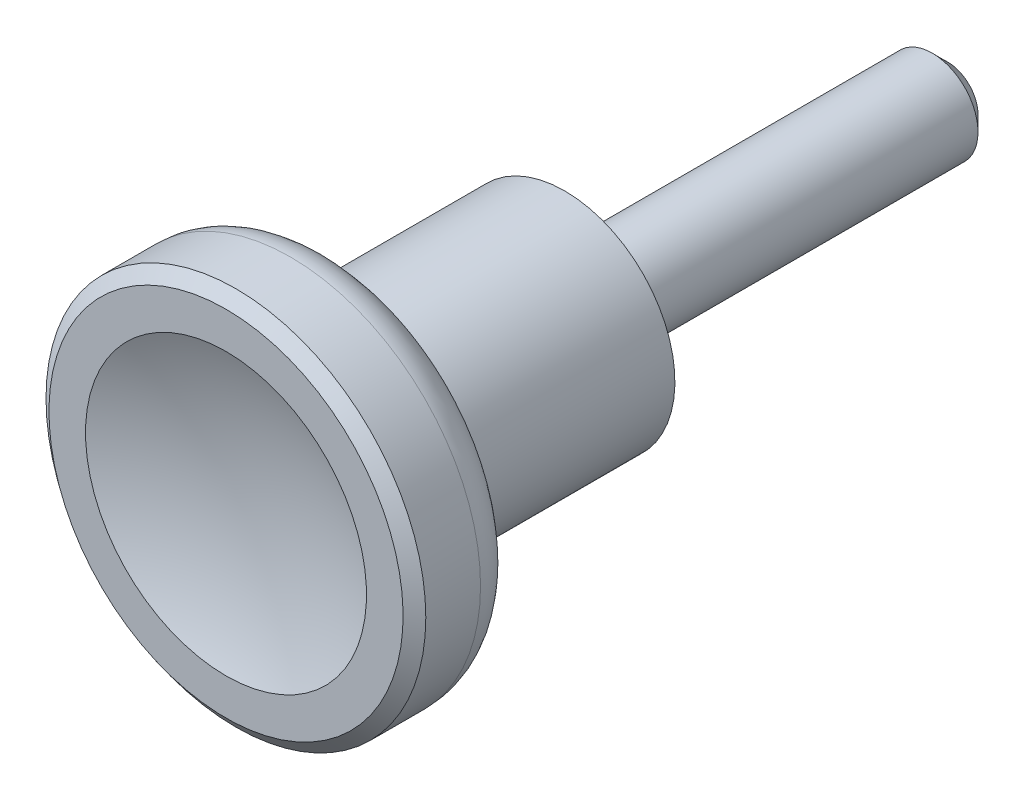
ISO-10303-21;
HEADER;
FILE_DESCRIPTION(('STEP AP214'),'2;1');
FILE_NAME('part.step','',(''),(''),'','','');
FILE_SCHEMA(('AUTOMOTIVE_DESIGN { 1 0 10303 214 1 1 1 1 }'));
ENDSEC;
DATA;
#1=APPLICATION_CONTEXT('core data for automotive mechanical design processes');
#2=APPLICATION_PROTOCOL_DEFINITION('international standard','automotive_design',2000,#1);
#3=PRODUCT_CONTEXT('',#1,'mechanical');
#4=PRODUCT('Part','Part','',(#3));
#5=PRODUCT_RELATED_PRODUCT_CATEGORY('part','',(#4));
#6=PRODUCT_DEFINITION_FORMATION('','',#4);
#7=PRODUCT_DEFINITION_CONTEXT('part definition',#1,'design');
#8=PRODUCT_DEFINITION('design','',#6,#7);
#9=PRODUCT_DEFINITION_SHAPE('','',#8);
#10=(LENGTH_UNIT() NAMED_UNIT(*) SI_UNIT(.MILLI.,.METRE.));
#11=(NAMED_UNIT(*) PLANE_ANGLE_UNIT() SI_UNIT($,.RADIAN.));
#12=(NAMED_UNIT(*) SI_UNIT($,.STERADIAN.) SOLID_ANGLE_UNIT());
#13=UNCERTAINTY_MEASURE_WITH_UNIT(LENGTH_MEASURE(1.E-05),#10,'distance_accuracy_value','');
#14=(GEOMETRIC_REPRESENTATION_CONTEXT(3) GLOBAL_UNCERTAINTY_ASSIGNED_CONTEXT((#13)) GLOBAL_UNIT_ASSIGNED_CONTEXT((#10,
#11,#12)) REPRESENTATION_CONTEXT('',''));
#15=CARTESIAN_POINT('',(0.,0.,0.));
#16=DIRECTION('',(0.,0.,1.));
#17=DIRECTION('',(1.,0.,0.));
#18=AXIS2_PLACEMENT_3D('',#15,#16,#17);
#19=CARTESIAN_POINT('',(0.,0.,43.6847281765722));
#20=DIRECTION('',(0.,-1.,0.));
#21=DIRECTION('',(1.,0.,0.));
#22=AXIS2_PLACEMENT_3D('',#19,#20,#21);
#23=SPHERICAL_SURFACE('',#22,23.1163945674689);
#24=CARTESIAN_POINT('',(0.,0.,43.6847281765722));
#25=DIRECTION('',(0.,0.,-1.));
#26=DIRECTION('',(0.,1.,0.));
#27=AXIS2_PLACEMENT_3D('',#24,#25,#26);
#28=SPHERICAL_SURFACE('',#27,23.1163945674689);
#29=CARTESIAN_POINT('',(0.,0.,22.4988392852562));
#30=DIRECTION('',(0.,0.,-1.));
#31=DIRECTION('',(0.,1.,0.));
#32=AXIS2_PLACEMENT_3D('',#29,#30,#31);
#33=CIRCLE('',#32,9.24801652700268);
#34=CARTESIAN_POINT('',(0.,9.24801652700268,22.4988392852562));
#35=VERTEX_POINT('',#34);
#36=EDGE_CURVE('E56',#35,#35,#33,.T.);
#37=ORIENTED_EDGE('',*,*,#36,.F.);
#38=EDGE_LOOP('',(#37));
#39=FACE_BOUND('',#38,.T.);
#40=ADVANCED_FACE('F12',(#39),#28,.F.);
#41=CARTESIAN_POINT('',(3.,0.,-25.));
#42=DIRECTION('',(0.,0.,1.));
#43=DIRECTION('',(0.,-1.,0.));
#44=AXIS2_PLACEMENT_3D('',#41,#42,#43);
#45=PLANE('',#44);
#46=CARTESIAN_POINT('',(0.,0.,-25.));
#47=DIRECTION('',(0.,0.,1.));
#48=DIRECTION('',(1.,0.,0.));
#49=AXIS2_PLACEMENT_3D('',#46,#47,#48);
#50=CIRCLE('',#49,2.);
#51=CARTESIAN_POINT('',(2.,0.,-25.));
#52=VERTEX_POINT('',#51);
#53=EDGE_CURVE('E19',#52,#52,#50,.F.);
#54=ORIENTED_EDGE('',*,*,#53,.T.);
#55=EDGE_LOOP('',(#54));
#56=FACE_BOUND('',#55,.T.);
#57=ADVANCED_FACE('F63',(#56),#45,.F.);
#58=CARTESIAN_POINT('',(0.,0.,-2.38339822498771));
#59=DIRECTION('',(0.,0.,-1.));
#60=DIRECTION('',(0.,1.,0.));
#61=AXIS2_PLACEMENT_3D('',#58,#59,#60);
#62=CYLINDRICAL_SURFACE('',#61,3.);
#63=CARTESIAN_POINT('',(0.,0.,-24.));
#64=DIRECTION('',(0.,0.,1.));
#65=DIRECTION('',(1.,0.,0.));
#66=AXIS2_PLACEMENT_3D('',#63,#64,#65);
#67=CIRCLE('',#66,3.);
#68=CARTESIAN_POINT('',(3.,0.,-24.));
#69=VERTEX_POINT('',#68);
#70=EDGE_CURVE('E8',#69,#69,#67,.T.);
#71=ORIENTED_EDGE('',*,*,#70,.T.);
#72=EDGE_LOOP('',(#71));
#73=FACE_BOUND('',#72,.T.);
#74=CARTESIAN_POINT('',(0.,0.,0.));
#75=DIRECTION('',(0.,0.,-1.));
#76=DIRECTION('',(0.,1.,0.));
#77=AXIS2_PLACEMENT_3D('',#74,#75,#76);
#78=CIRCLE('',#77,3.);
#79=CARTESIAN_POINT('',(0.,3.,0.));
#80=VERTEX_POINT('',#79);
#81=EDGE_CURVE('E23',#80,#80,#78,.T.);
#82=ORIENTED_EDGE('',*,*,#81,.T.);
#83=EDGE_LOOP('',(#82));
#84=FACE_BOUND('',#83,.T.);
#85=ADVANCED_FACE('F69',(#73,#84),#62,.T.);
#86=CARTESIAN_POINT('',(3.,0.,0.));
#87=DIRECTION('',(0.,0.,-1.));
#88=DIRECTION('',(0.,1.,0.));
#89=AXIS2_PLACEMENT_3D('',#86,#87,#88);
#90=PLANE('',#89);
#91=CARTESIAN_POINT('',(0.,0.,0.));
#92=DIRECTION('',(0.,0.,-1.));
#93=DIRECTION('',(0.,1.,0.));
#94=AXIS2_PLACEMENT_3D('',#91,#92,#93);
#95=CIRCLE('',#94,4.5);
#96=CARTESIAN_POINT('',(0.,4.5,0.));
#97=VERTEX_POINT('',#96);
#98=EDGE_CURVE('E27',#97,#97,#95,.T.);
#99=ORIENTED_EDGE('',*,*,#98,.T.);
#100=EDGE_LOOP('',(#99));
#101=FACE_BOUND('',#100,.T.);
#102=ORIENTED_EDGE('',*,*,#81,.F.);
#103=EDGE_LOOP('',(#102));
#104=FACE_BOUND('',#103,.T.);
#105=ADVANCED_FACE('F74',(#101,#104),#90,.T.);
#106=CARTESIAN_POINT('',(0.,0.,-2.38339822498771));
#107=DIRECTION('',(0.,0.,-1.));
#108=DIRECTION('',(0.,1.,0.));
#109=AXIS2_PLACEMENT_3D('',#106,#107,#108);
#110=CYLINDRICAL_SURFACE('',#109,4.5);
#111=ORIENTED_EDGE('',*,*,#98,.F.);
#112=EDGE_LOOP('',(#111));
#113=FACE_BOUND('',#112,.T.);
#114=CARTESIAN_POINT('',(0.,0.,0.200000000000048));
#115=DIRECTION('',(0.,0.,-1.));
#116=DIRECTION('',(0.,1.,0.));
#117=AXIS2_PLACEMENT_3D('',#114,#115,#116);
#118=CIRCLE('',#117,4.5);
#119=CARTESIAN_POINT('',(0.,4.5,0.200000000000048));
#120=VERTEX_POINT('',#119);
#121=EDGE_CURVE('E32',#120,#120,#118,.T.);
#122=ORIENTED_EDGE('',*,*,#121,.T.);
#123=EDGE_LOOP('',(#122));
#124=FACE_BOUND('',#123,.T.);
#125=ADVANCED_FACE('F77',(#113,#124),#110,.T.);
#126=CARTESIAN_POINT('',(4.5000000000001,0.,0.200000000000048));
#127=DIRECTION('',(0.,0.,-1.));
#128=DIRECTION('',(0.,1.,0.));
#129=AXIS2_PLACEMENT_3D('',#126,#127,#128);
#130=PLANE('',#129);
#131=CARTESIAN_POINT('',(0.,0.,0.200000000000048));
#132=DIRECTION('',(0.,0.,-1.));
#133=DIRECTION('',(0.,1.,0.));
#134=AXIS2_PLACEMENT_3D('',#131,#132,#133);
#135=CIRCLE('',#134,7.25);
#136=CARTESIAN_POINT('',(0.,7.25,0.200000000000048));
#137=VERTEX_POINT('',#136);
#138=EDGE_CURVE('E35',#137,#137,#135,.T.);
#139=ORIENTED_EDGE('',*,*,#138,.T.);
#140=EDGE_LOOP('',(#139));
#141=FACE_BOUND('',#140,.T.);
#142=ORIENTED_EDGE('',*,*,#121,.F.);
#143=EDGE_LOOP('',(#142));
#144=FACE_BOUND('',#143,.T.);
#145=ADVANCED_FACE('F81',(#141,#144),#130,.T.);
#146=CARTESIAN_POINT('',(0.,0.,-2.38339822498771));
#147=DIRECTION('',(0.,0.,-1.));
#148=DIRECTION('',(0.,1.,0.));
#149=AXIS2_PLACEMENT_3D('',#146,#147,#148);
#150=CYLINDRICAL_SURFACE('',#149,7.25);
#151=CARTESIAN_POINT('',(0.,0.,14.));
#152=DIRECTION('',(0.,0.,-1.));
#153=DIRECTION('',(0.,1.,0.));
#154=AXIS2_PLACEMENT_3D('',#151,#152,#153);
#155=CIRCLE('',#154,7.25);
#156=CARTESIAN_POINT('',(0.,7.25,14.));
#157=VERTEX_POINT('',#156);
#158=EDGE_CURVE('E38',#157,#157,#155,.T.);
#159=ORIENTED_EDGE('',*,*,#158,.T.);
#160=EDGE_LOOP('',(#159));
#161=FACE_BOUND('',#160,.T.);
#162=ORIENTED_EDGE('',*,*,#138,.F.);
#163=EDGE_LOOP('',(#162));
#164=FACE_BOUND('',#163,.T.);
#165=ADVANCED_FACE('F85',(#161,#164),#150,.T.);
#166=CARTESIAN_POINT('',(0.,0.,14.));
#167=DIRECTION('',(0.,0.,-1.));
#168=DIRECTION('',(0.,1.,0.));
#169=AXIS2_PLACEMENT_3D('',#166,#167,#168);
#170=TOROIDAL_SURFACE('',#169,7.75,0.5);
#171=ORIENTED_EDGE('',*,*,#158,.F.);
#172=EDGE_LOOP('',(#171));
#173=FACE_BOUND('',#172,.T.);
#174=CARTESIAN_POINT('',(0.,0.,14.4670163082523));
#175=DIRECTION('',(0.,0.,-1.));
#176=DIRECTION('',(0.,1.,0.));
#177=AXIS2_PLACEMENT_3D('',#174,#175,#176);
#178=CIRCLE('',#177,7.57140613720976);
#179=CARTESIAN_POINT('',(0.,7.57140613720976,14.4670163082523));
#180=VERTEX_POINT('',#179);
#181=EDGE_CURVE('E41',#180,#180,#178,.T.);
#182=ORIENTED_EDGE('',*,*,#181,.T.);
#183=EDGE_LOOP('',(#182));
#184=FACE_BOUND('',#183,.T.);
#185=ADVANCED_FACE('F89',(#173,#184),#170,.F.);
#186=CARTESIAN_POINT('',(0.,0.,14.4670163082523));
#187=DIRECTION('',(0.,0.,1.));
#188=DIRECTION('',(0.,-1.,0.));
#189=AXIS2_PLACEMENT_3D('',#186,#187,#188);
#190=CONICAL_SURFACE('',#189,7.57140613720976,1.20554106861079);
#191=CARTESIAN_POINT('',(0.,0.,15.675774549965));
#192=DIRECTION('',(0.,0.,-1.));
#193=DIRECTION('',(0.,1.,0.));
#194=AXIS2_PLACEMENT_3D('',#191,#192,#193);
#195=CIRCLE('',#194,10.7322639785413);
#196=CARTESIAN_POINT('',(0.,10.7322639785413,15.675774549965));
#197=VERTEX_POINT('',#196);
#198=EDGE_CURVE('E44',#197,#197,#195,.T.);
#199=ORIENTED_EDGE('',*,*,#198,.T.);
#200=EDGE_LOOP('',(#199));
#201=FACE_BOUND('',#200,.T.);
#202=ORIENTED_EDGE('',*,*,#181,.F.);
#203=EDGE_LOOP('',(#202));
#204=FACE_BOUND('',#203,.T.);
#205=ADVANCED_FACE('F93',(#201,#204),#190,.T.);
#206=CARTESIAN_POINT('',(0.,0.,18.2443675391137));
#207=DIRECTION('',(0.,0.,-1.));
#208=DIRECTION('',(0.,1.,0.));
#209=AXIS2_PLACEMENT_3D('',#206,#207,#208);
#210=TOROIDAL_SURFACE('',#209,9.74999647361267,2.75000352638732);
#211=CARTESIAN_POINT('',(0.,0.,18.2443675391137));
#212=DIRECTION('',(0.,0.,-1.));
#213=DIRECTION('',(0.,1.,0.));
#214=AXIS2_PLACEMENT_3D('',#211,#212,#213);
#215=CIRCLE('',#214,12.5);
#216=CARTESIAN_POINT('',(0.,12.5,18.2443675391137));
#217=VERTEX_POINT('',#216);
#218=EDGE_CURVE('E47',#217,#217,#215,.T.);
#219=ORIENTED_EDGE('',*,*,#218,.T.);
#220=EDGE_LOOP('',(#219));
#221=FACE_BOUND('',#220,.T.);
#222=ORIENTED_EDGE('',*,*,#198,.F.);
#223=EDGE_LOOP('',(#222));
#224=FACE_BOUND('',#223,.T.);
#225=ADVANCED_FACE('F97',(#221,#224),#210,.T.);
#226=CARTESIAN_POINT('',(0.,0.,-2.38339822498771));
#227=DIRECTION('',(0.,0.,-1.));
#228=DIRECTION('',(0.,1.,0.));
#229=AXIS2_PLACEMENT_3D('',#226,#227,#228);
#230=CYLINDRICAL_SURFACE('',#229,12.5);
#231=ORIENTED_EDGE('',*,*,#218,.F.);
#232=EDGE_LOOP('',(#231));
#233=FACE_BOUND('',#232,.T.);
#234=CARTESIAN_POINT('',(0.,0.,21.8478667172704));
#235=DIRECTION('',(0.,0.,-1.));
#236=DIRECTION('',(0.,1.,0.));
#237=AXIS2_PLACEMENT_3D('',#234,#235,#236);
#238=CIRCLE('',#237,12.5);
#239=CARTESIAN_POINT('',(0.,12.5,21.8478667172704));
#240=VERTEX_POINT('',#239);
#241=EDGE_CURVE('E50',#240,#240,#238,.T.);
#242=ORIENTED_EDGE('',*,*,#241,.T.);
#243=EDGE_LOOP('',(#242));
#244=FACE_BOUND('',#243,.T.);
#245=ADVANCED_FACE('F101',(#233,#244),#230,.T.);
#246=CARTESIAN_POINT('',(0.,0.,22.4983919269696));
#247=DIRECTION('',(0.,0.,-1.));
#248=DIRECTION('',(0.,1.,0.));
#249=AXIS2_PLACEMENT_3D('',#246,#247,#248);
#250=CONICAL_SURFACE('',#249,11.6552976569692,0.914540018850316);
#251=ORIENTED_EDGE('',*,*,#241,.F.);
#252=EDGE_LOOP('',(#251));
#253=FACE_BOUND('',#252,.T.);
#254=CARTESIAN_POINT('',(0.,0.,22.4983919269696));
#255=DIRECTION('',(0.,0.,-1.));
#256=DIRECTION('',(0.,1.,0.));
#257=AXIS2_PLACEMENT_3D('',#254,#255,#256);
#258=CIRCLE('',#257,11.6552976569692);
#259=CARTESIAN_POINT('',(0.,11.6552976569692,22.4983919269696));
#260=VERTEX_POINT('',#259);
#261=EDGE_CURVE('E53',#260,#260,#258,.T.);
#262=ORIENTED_EDGE('',*,*,#261,.T.);
#263=EDGE_LOOP('',(#262));
#264=FACE_BOUND('',#263,.T.);
#265=ADVANCED_FACE('F105',(#253,#264),#250,.T.);
#266=CARTESIAN_POINT('',(0.,0.,22.4988392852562));
#267=DIRECTION('',(0.,0.,-1.));
#268=DIRECTION('',(0.,1.,0.));
#269=AXIS2_PLACEMENT_3D('',#266,#267,#268);
#270=CONICAL_SURFACE('',#269,9.24801652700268,1.57061049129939);
#271=ORIENTED_EDGE('',*,*,#261,.F.);
#272=EDGE_LOOP('',(#271));
#273=FACE_BOUND('',#272,.T.);
#274=ORIENTED_EDGE('',*,*,#36,.T.);
#275=EDGE_LOOP('',(#274));
#276=FACE_BOUND('',#275,.T.);
#277=ADVANCED_FACE('F60',(#273,#276),#270,.T.);
#278=CARTESIAN_POINT('',(0.,0.,-25.));
#279=DIRECTION('',(0.,0.,1.));
#280=DIRECTION('',(1.,0.,0.));
#281=AXIS2_PLACEMENT_3D('',#278,#279,#280);
#282=CONICAL_SURFACE('',#281,2.,0.785398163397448);
#283=ORIENTED_EDGE('',*,*,#70,.F.);
#284=EDGE_LOOP('',(#283));
#285=FACE_BOUND('',#284,.T.);
#286=ORIENTED_EDGE('',*,*,#53,.F.);
#287=EDGE_LOOP('',(#286));
#288=FACE_BOUND('',#287,.T.);
#289=ADVANCED_FACE('F14',(#285,#288),#282,.T.);
#290=CLOSED_SHELL('',(#40,#57,#85,#105,#125,#145,#165,#185,#205,#225,#245,#265,#277,#289));
#291=MANIFOLD_SOLID_BREP('B1',#290);
#292=ADVANCED_BREP_SHAPE_REPRESENTATION('',(#18,#291),#14);
#293=SHAPE_DEFINITION_REPRESENTATION(#9,#292);
ENDSEC;
END-ISO-10303-21;
